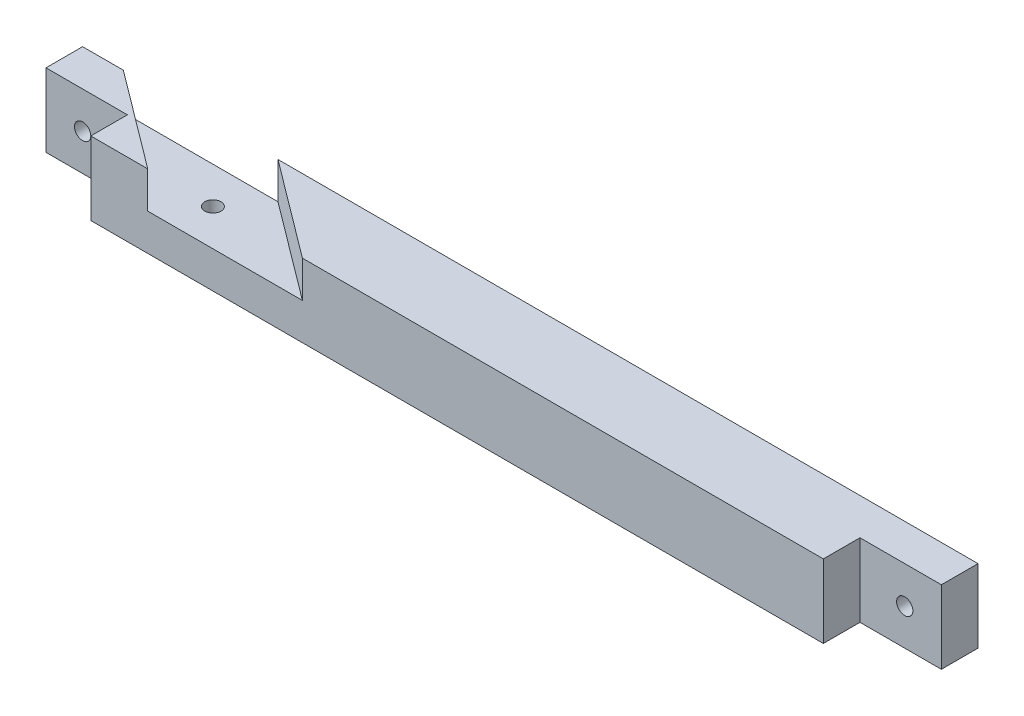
from build123d import *

# Parameters (mm, degrees)
ESQUISSE1_W             = 110
ESQUISSE1_H             = 9
EXTRUSION1_DEPTH        = 9
ESQUISSE2_W             = 10
ESQUISSE2_H             = 9
ENL_V_MAT_EXTRU_1_DEPTH = 4.5
ESQUISSE4_R             = 1
ENL_V_MAT_EXTRU_2_DEPTH = 4.5
ESQUISSE5_R             = 1
ENL_V_MAT_EXTRU_3_DEPTH = 4.5
ENL_V_MAT_EXTRU_4_DEPTH = 4.5
ESQUISSE7_R             = 1
ENL_V_MAT_EXTRU_5_DEPTH = 4.5


with BuildPart() as part:
    # Esquisse1 → Extrusion1 (new body)
    with BuildSketch(Plane.XY):
        with Locations((-12.271684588, -105.117562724)):
            Rectangle(ESQUISSE1_W, ESQUISSE1_H)
    extrude(amount=EXTRUSION1_DEPTH)

    # Esquisse2 → Enl_v. mat.-Extru.1 (cut)
    with BuildSketch(Plane.XY.offset(9)):
        with Locations((-62.271684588, -105.117562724)):
            Rectangle(ESQUISSE2_W, ESQUISSE2_H)
        with Locations((37.728315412, -105.117562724)):
            Rectangle(ESQUISSE2_W, ESQUISSE2_H)
    extrude(amount=-ENL_V_MAT_EXTRU_1_DEPTH, mode=Mode.SUBTRACT)

    # Esquisse4 → Enl_v. mat.-Extru.2 (cut)
    with BuildSketch(Plane.XY.offset(4.5)):
        with Locations((38.22840174, -105.145436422)):
            Circle(ESQUISSE4_R)
    extrude(amount=-ENL_V_MAT_EXTRU_2_DEPTH, mode=Mode.SUBTRACT)

    # Esquisse5 → Enl_v. mat.-Extru.3 (cut)
    with BuildSketch(Plane.XY.offset(4.5)):
        with Locations((-62.771684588, -105.117562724)):
            Circle(ESQUISSE5_R)
    extrude(amount=-ENL_V_MAT_EXTRU_3_DEPTH, mode=Mode.SUBTRACT)

    # Esquisse6 → Enl_v. mat.-Extru.4 (cut)
    with BuildSketch(Plane(origin=(0, -100.617562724, 0), x_dir=(1, 0, 0), z_dir=(0, 1, 0))):
        Polygon((-62.271684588, 0), (-43.271684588, 0), (-31.271684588, -9), (-50.271684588, -9), align=None)
    extrude(amount=-ENL_V_MAT_EXTRU_4_DEPTH, mode=Mode.SUBTRACT)

    # Esquisse7 → Enl_v. mat.-Extru.5 (cut)
    with BuildSketch(Plane(origin=(0, -105.117562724, 0), x_dir=(1, 0, 0), z_dir=(0, 1, 0))):
        with Locations(Location((-46.771684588, -4.5, 0), (0, 0, 270))):
            Circle(ESQUISSE7_R)
    extrude(amount=-ENL_V_MAT_EXTRU_5_DEPTH, mode=Mode.SUBTRACT)


solid = part.part
